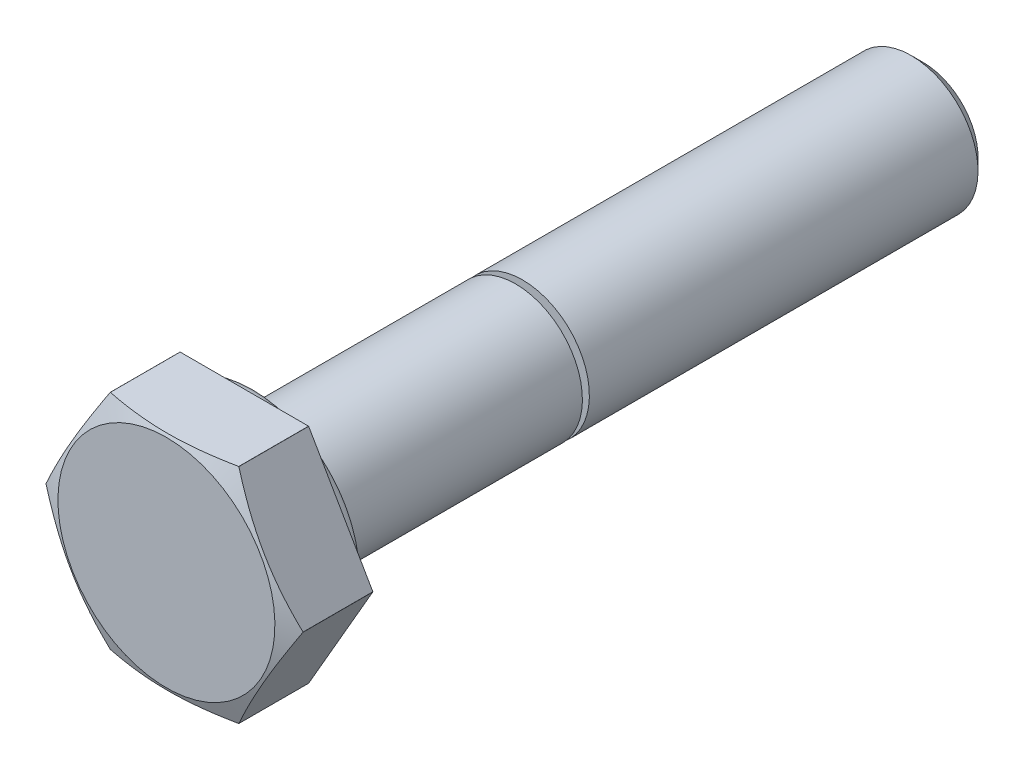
ISO-10303-21;
HEADER;
FILE_DESCRIPTION(('STEP AP214'),'2;1');
FILE_NAME('part.step','',(''),(''),'','','');
FILE_SCHEMA(('AUTOMOTIVE_DESIGN { 1 0 10303 214 1 1 1 1 }'));
ENDSEC;
DATA;
#1=APPLICATION_CONTEXT('core data for automotive mechanical design processes');
#2=APPLICATION_PROTOCOL_DEFINITION('international standard','automotive_design',2000,#1);
#3=PRODUCT_CONTEXT('',#1,'mechanical');
#4=PRODUCT('Part','Part','',(#3));
#5=PRODUCT_RELATED_PRODUCT_CATEGORY('part','',(#4));
#6=PRODUCT_DEFINITION_FORMATION('','',#4);
#7=PRODUCT_DEFINITION_CONTEXT('part definition',#1,'design');
#8=PRODUCT_DEFINITION('design','',#6,#7);
#9=PRODUCT_DEFINITION_SHAPE('','',#8);
#10=(LENGTH_UNIT() NAMED_UNIT(*) SI_UNIT(.MILLI.,.METRE.));
#11=(NAMED_UNIT(*) PLANE_ANGLE_UNIT() SI_UNIT($,.RADIAN.));
#12=(NAMED_UNIT(*) SI_UNIT($,.STERADIAN.) SOLID_ANGLE_UNIT());
#13=UNCERTAINTY_MEASURE_WITH_UNIT(LENGTH_MEASURE(1.E-05),#10,'distance_accuracy_value','');
#14=(GEOMETRIC_REPRESENTATION_CONTEXT(3) GLOBAL_UNCERTAINTY_ASSIGNED_CONTEXT((#13)) GLOBAL_UNIT_ASSIGNED_CONTEXT((#10,
#11,#12)) REPRESENTATION_CONTEXT('',''));
#15=CARTESIAN_POINT('',(0.,0.,0.));
#16=DIRECTION('',(0.,0.,1.));
#17=DIRECTION('',(1.,0.,0.));
#18=AXIS2_PLACEMENT_3D('',#15,#16,#17);
#19=CARTESIAN_POINT('',(0.,1.229375,-30.));
#20=DIRECTION('',(0.,0.,-1.));
#21=DIRECTION('',(0.,1.,0.));
#22=AXIS2_PLACEMENT_3D('',#19,#20,#21);
#23=PLANE('',#22);
#24=CARTESIAN_POINT('',(0.,0.,-30.));
#25=DIRECTION('',(0.,0.,-1.));
#26=DIRECTION('',(0.,1.,0.));
#27=AXIS2_PLACEMENT_3D('',#24,#25,#26);
#28=CIRCLE('',#27,2.45875);
#29=CARTESIAN_POINT('',(0.,2.45875,-30.));
#30=VERTEX_POINT('',#29);
#31=EDGE_CURVE('E10',#30,#30,#28,.T.);
#32=ORIENTED_EDGE('',*,*,#31,.T.);
#33=EDGE_LOOP('',(#32));
#34=FACE_BOUND('',#33,.T.);
#35=ADVANCED_FACE('F16',(#34),#23,.T.);
#36=CARTESIAN_POINT('',(0.,0.,-29.729375));
#37=DIRECTION('',(0.,0.,1.));
#38=DIRECTION('',(0.,1.,0.));
#39=AXIS2_PLACEMENT_3D('',#36,#37,#38);
#40=CONICAL_SURFACE('',#39,2.729375,0.78539816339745);
#41=CARTESIAN_POINT('',(0.,0.,-29.45875));
#42=DIRECTION('',(0.,0.,-1.));
#43=DIRECTION('',(0.,1.,0.));
#44=AXIS2_PLACEMENT_3D('',#41,#42,#43);
#45=CIRCLE('',#44,3.);
#46=CARTESIAN_POINT('',(0.,3.,-29.45875));
#47=VERTEX_POINT('',#46);
#48=EDGE_CURVE('E19',#47,#47,#45,.T.);
#49=ORIENTED_EDGE('',*,*,#48,.T.);
#50=EDGE_LOOP('',(#49));
#51=FACE_BOUND('',#50,.T.);
#52=ORIENTED_EDGE('',*,*,#31,.F.);
#53=EDGE_LOOP('',(#52));
#54=FACE_BOUND('',#53,.T.);
#55=ADVANCED_FACE('F148',(#51,#54),#40,.T.);
#56=CARTESIAN_POINT('',(0.,0.,-20.729375));
#57=DIRECTION('',(0.,0.,1.));
#58=DIRECTION('',(0.,1.,0.));
#59=AXIS2_PLACEMENT_3D('',#56,#57,#58);
#60=CYLINDRICAL_SURFACE('',#59,3.);
#61=CARTESIAN_POINT('',(0.,0.,-12.));
#62=DIRECTION('',(0.,0.,-1.));
#63=DIRECTION('',(0.,1.,0.));
#64=AXIS2_PLACEMENT_3D('',#61,#62,#63);
#65=CIRCLE('',#64,3.);
#66=CARTESIAN_POINT('',(0.,3.,-12.));
#67=VERTEX_POINT('',#66);
#68=EDGE_CURVE('E127',#67,#67,#65,.T.);
#69=ORIENTED_EDGE('',*,*,#68,.T.);
#70=EDGE_LOOP('',(#69));
#71=FACE_BOUND('',#70,.T.);
#72=ORIENTED_EDGE('',*,*,#48,.F.);
#73=EDGE_LOOP('',(#72));
#74=FACE_BOUND('',#73,.T.);
#75=ADVANCED_FACE('F134',(#71,#74),#60,.T.);
#76=CARTESIAN_POINT('',(0.,2.729375,-12.));
#77=DIRECTION('',(0.,0.,1.));
#78=DIRECTION('',(0.,-1.,0.));
#79=AXIS2_PLACEMENT_3D('',#76,#77,#78);
#80=PLANE('',#79);
#81=CARTESIAN_POINT('',(0.,0.,-12.));
#82=DIRECTION('',(0.,0.,-1.));
#83=DIRECTION('',(0.,1.,0.));
#84=AXIS2_PLACEMENT_3D('',#81,#82,#83);
#85=CIRCLE('',#84,2.45875);
#86=CARTESIAN_POINT('',(0.,2.45875,-12.));
#87=VERTEX_POINT('',#86);
#88=EDGE_CURVE('E124',#87,#87,#85,.T.);
#89=ORIENTED_EDGE('',*,*,#88,.T.);
#90=EDGE_LOOP('',(#89));
#91=FACE_BOUND('',#90,.T.);
#92=ORIENTED_EDGE('',*,*,#68,.F.);
#93=EDGE_LOOP('',(#92));
#94=FACE_BOUND('',#93,.T.);
#95=ADVANCED_FACE('F137',(#91,#94),#80,.T.);
#96=CARTESIAN_POINT('',(0.,0.,-11.8437545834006));
#97=DIRECTION('',(0.,0.,1.));
#98=DIRECTION('',(0.,1.,0.));
#99=AXIS2_PLACEMENT_3D('',#96,#97,#98);
#100=CONICAL_SURFACE('',#99,2.729375,1.0471975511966);
#101=CARTESIAN_POINT('',(0.,0.,-11.6875091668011));
#102=DIRECTION('',(0.,0.,-1.));
#103=DIRECTION('',(0.,1.,0.));
#104=AXIS2_PLACEMENT_3D('',#101,#102,#103);
#105=CIRCLE('',#104,3.);
#106=CARTESIAN_POINT('',(0.,3.,-11.6875091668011));
#107=VERTEX_POINT('',#106);
#108=EDGE_CURVE('E120',#107,#107,#105,.T.);
#109=ORIENTED_EDGE('',*,*,#108,.T.);
#110=EDGE_LOOP('',(#109));
#111=FACE_BOUND('',#110,.T.);
#112=ORIENTED_EDGE('',*,*,#88,.F.);
#113=EDGE_LOOP('',(#112));
#114=FACE_BOUND('',#113,.T.);
#115=ADVANCED_FACE('F121',(#111,#114),#100,.T.);
#116=CARTESIAN_POINT('',(0.,0.,-5.99375458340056));
#117=DIRECTION('',(0.,0.,1.));
#118=DIRECTION('',(0.,1.,0.));
#119=AXIS2_PLACEMENT_3D('',#116,#117,#118);
#120=CYLINDRICAL_SURFACE('',#119,3.);
#121=CARTESIAN_POINT('',(0.,0.,-0.3));
#122=DIRECTION('',(0.,0.,-1.));
#123=DIRECTION('',(0.,1.,0.));
#124=AXIS2_PLACEMENT_3D('',#121,#122,#123);
#125=CIRCLE('',#124,3.);
#126=CARTESIAN_POINT('',(0.,3.,-0.3));
#127=VERTEX_POINT('',#126);
#128=EDGE_CURVE('E125',#127,#127,#125,.T.);
#129=ORIENTED_EDGE('',*,*,#128,.T.);
#130=EDGE_LOOP('',(#129));
#131=FACE_BOUND('',#130,.T.);
#132=ORIENTED_EDGE('',*,*,#108,.F.);
#133=EDGE_LOOP('',(#132));
#134=FACE_BOUND('',#133,.T.);
#135=ADVANCED_FACE('F146',(#131,#134),#120,.T.);
#136=CARTESIAN_POINT('',(0.,0.,-0.3));
#137=DIRECTION('',(0.,0.,-1.));
#138=DIRECTION('',(-1.,0.,0.));
#139=AXIS2_PLACEMENT_3D('',#136,#137,#138);
#140=TOROIDAL_SURFACE('',#139,3.3,0.3);
#141=CARTESIAN_POINT('',(0.,0.,0.));
#142=DIRECTION('',(0.,0.,-1.));
#143=DIRECTION('',(0.,1.,0.));
#144=AXIS2_PLACEMENT_3D('',#141,#142,#143);
#145=CIRCLE('',#144,3.3);
#146=CARTESIAN_POINT('',(0.,3.3,0.));
#147=VERTEX_POINT('',#146);
#148=EDGE_CURVE('E129',#147,#147,#145,.T.);
#149=ORIENTED_EDGE('',*,*,#148,.T.);
#150=EDGE_LOOP('',(#149));
#151=FACE_BOUND('',#150,.T.);
#152=ORIENTED_EDGE('',*,*,#128,.F.);
#153=EDGE_LOOP('',(#152));
#154=FACE_BOUND('',#153,.T.);
#155=ADVANCED_FACE('F191',(#151,#154),#140,.F.);
#156=CARTESIAN_POINT('',(0.,3.875,0.));
#157=DIRECTION('',(0.,0.,-1.));
#158=DIRECTION('',(0.,1.,0.));
#159=AXIS2_PLACEMENT_3D('',#156,#157,#158);
#160=PLANE('',#159);
#161=CARTESIAN_POINT('',(0.,0.,0.));
#162=DIRECTION('',(0.,0.,-1.));
#163=DIRECTION('',(0.,1.,0.));
#164=AXIS2_PLACEMENT_3D('',#161,#162,#163);
#165=CIRCLE('',#164,4.45);
#166=CARTESIAN_POINT('',(0.,4.45,0.));
#167=VERTEX_POINT('',#166);
#168=EDGE_CURVE('E422',#167,#167,#165,.T.);
#169=ORIENTED_EDGE('',*,*,#168,.T.);
#170=EDGE_LOOP('',(#169));
#171=FACE_BOUND('',#170,.T.);
#172=ORIENTED_EDGE('',*,*,#148,.F.);
#173=EDGE_LOOP('',(#172));
#174=FACE_BOUND('',#173,.T.);
#175=ADVANCED_FACE('F200',(#171,#174),#160,.T.);
#176=CARTESIAN_POINT('',(0.,0.,0.5));
#177=DIRECTION('',(0.,0.,-1.));
#178=DIRECTION('',(-1.,0.,0.));
#179=AXIS2_PLACEMENT_3D('',#176,#177,#178);
#180=TOROIDAL_SURFACE('',#179,4.45,0.5);
#181=CARTESIAN_POINT('',(0.,0.,0.5));
#182=DIRECTION('',(0.,0.,-1.));
#183=DIRECTION('',(0.,1.,0.));
#184=AXIS2_PLACEMENT_3D('',#181,#182,#183);
#185=CIRCLE('',#184,4.95);
#186=CARTESIAN_POINT('',(0.,4.95,0.5));
#187=VERTEX_POINT('',#186);
#188=EDGE_CURVE('E424',#187,#187,#185,.T.);
#189=ORIENTED_EDGE('',*,*,#188,.T.);
#190=EDGE_LOOP('',(#189));
#191=FACE_BOUND('',#190,.T.);
#192=ORIENTED_EDGE('',*,*,#168,.F.);
#193=EDGE_LOOP('',(#192));
#194=FACE_BOUND('',#193,.T.);
#195=ADVANCED_FACE('F210',(#191,#194),#180,.T.);
#196=CARTESIAN_POINT('',(0.,5.36175,0.5));
#197=DIRECTION('',(0.,0.,-1.));
#198=DIRECTION('',(0.,1.,0.));
#199=AXIS2_PLACEMENT_3D('',#196,#197,#198);
#200=PLANE('',#199);
#201=ORIENTED_EDGE('',*,*,#188,.F.);
#202=EDGE_LOOP('',(#201));
#203=FACE_BOUND('',#202,.T.);
#204=DIRECTION('',(0.5,-0.866025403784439,0.));
#205=VECTOR('',#204,1.);
#206=CARTESIAN_POINT('',(-5.4921029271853,-0.489992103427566,0.5));
#207=LINE('',#206,#205);
#208=CARTESIAN_POINT('',(-5.77349941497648,-0.00259908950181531,0.5));
#209=VERTEX_POINT('',#208);
#210=CARTESIAN_POINT('',(-2.88900058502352,-4.99869761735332,0.5));
#211=VERTEX_POINT('',#210);
#212=EDGE_CURVE('E390',#209,#211,#207,.T.);
#213=ORIENTED_EDGE('',*,*,#212,.F.);
#214=CARTESIAN_POINT('',(0.,0.,0.5));
#215=DIRECTION('',(0.,0.,-1.));
#216=DIRECTION('',(0.,1.,0.));
#217=AXIS2_PLACEMENT_3D('',#214,#215,#216);
#218=CIRCLE('',#217,5.7735);
#219=CARTESIAN_POINT('',(-5.77349941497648,0.00259908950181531,0.5));
#220=VERTEX_POINT('',#219);
#221=EDGE_CURVE('E511',#209,#220,#218,.T.);
#222=ORIENTED_EDGE('',*,*,#221,.T.);
#223=DIRECTION('',(-0.5,-0.866025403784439,0.));
#224=VECTOR('',#223,1.);
#225=CARTESIAN_POINT('',(-3.1703970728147,4.51130460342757,0.5));
#226=LINE('',#225,#224);
#227=CARTESIAN_POINT('',(-2.88900058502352,4.99869761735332,0.5));
#228=VERTEX_POINT('',#227);
#229=EDGE_CURVE('E481',#228,#220,#226,.T.);
#230=ORIENTED_EDGE('',*,*,#229,.F.);
#231=CARTESIAN_POINT('',(0.,0.,0.5));
#232=DIRECTION('',(0.,0.,-1.));
#233=DIRECTION('',(0.,1.,0.));
#234=AXIS2_PLACEMENT_3D('',#231,#232,#233);
#235=CIRCLE('',#234,5.7735);
#236=CARTESIAN_POINT('',(-2.88449882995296,5.00129670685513,0.5));
#237=VERTEX_POINT('',#236);
#238=EDGE_CURVE('E500',#228,#237,#235,.T.);
#239=ORIENTED_EDGE('',*,*,#238,.T.);
#240=DIRECTION('',(-1.,0.,0.));
#241=VECTOR('',#240,1.);
#242=CARTESIAN_POINT('',(0.,5.00129670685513,0.5));
#243=LINE('',#242,#241);
#244=CARTESIAN_POINT('',(2.88449882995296,5.00129670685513,0.5));
#245=VERTEX_POINT('',#244);
#246=EDGE_CURVE('E464',#245,#237,#243,.T.);
#247=ORIENTED_EDGE('',*,*,#246,.F.);
#248=CARTESIAN_POINT('',(0.,0.,0.5));
#249=DIRECTION('',(0.,0.,-1.));
#250=DIRECTION('',(0.,1.,0.));
#251=AXIS2_PLACEMENT_3D('',#248,#249,#250);
#252=CIRCLE('',#251,5.7735);
#253=CARTESIAN_POINT('',(2.88900058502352,4.99869761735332,0.5));
#254=VERTEX_POINT('',#253);
#255=EDGE_CURVE('E491',#245,#254,#252,.T.);
#256=ORIENTED_EDGE('',*,*,#255,.T.);
#257=DIRECTION('',(-0.5,0.866025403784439,0.));
#258=VECTOR('',#257,1.);
#259=CARTESIAN_POINT('',(3.1703970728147,4.51130460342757,0.5));
#260=LINE('',#259,#258);
#261=CARTESIAN_POINT('',(5.77349941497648,0.00259908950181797,0.5));
#262=VERTEX_POINT('',#261);
#263=EDGE_CURVE('E395',#262,#254,#260,.T.);
#264=ORIENTED_EDGE('',*,*,#263,.F.);
#265=CARTESIAN_POINT('',(0.,0.,0.5));
#266=DIRECTION('',(0.,0.,-1.));
#267=DIRECTION('',(0.,1.,0.));
#268=AXIS2_PLACEMENT_3D('',#265,#266,#267);
#269=CIRCLE('',#268,5.7735);
#270=CARTESIAN_POINT('',(5.77349941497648,-0.00259908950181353,0.5));
#271=VERTEX_POINT('',#270);
#272=EDGE_CURVE('E487',#262,#271,#269,.T.);
#273=ORIENTED_EDGE('',*,*,#272,.T.);
#274=DIRECTION('',(0.5,0.866025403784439,0.));
#275=VECTOR('',#274,1.);
#276=CARTESIAN_POINT('',(5.49210292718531,-0.489992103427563,0.5));
#277=LINE('',#276,#275);
#278=CARTESIAN_POINT('',(2.88900058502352,-4.99869761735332,0.5));
#279=VERTEX_POINT('',#278);
#280=EDGE_CURVE('E403',#279,#271,#277,.T.);
#281=ORIENTED_EDGE('',*,*,#280,.F.);
#282=CARTESIAN_POINT('',(0.,0.,0.5));
#283=DIRECTION('',(0.,0.,-1.));
#284=DIRECTION('',(0.,1.,0.));
#285=AXIS2_PLACEMENT_3D('',#282,#283,#284);
#286=CIRCLE('',#285,5.7735);
#287=CARTESIAN_POINT('',(2.88449882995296,-5.00129670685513,0.5));
#288=VERTEX_POINT('',#287);
#289=EDGE_CURVE('E496',#279,#288,#286,.T.);
#290=ORIENTED_EDGE('',*,*,#289,.T.);
#291=DIRECTION('',(1.,0.,0.));
#292=VECTOR('',#291,1.);
#293=CARTESIAN_POINT('',(0.,-5.00129670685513,0.5));
#294=LINE('',#293,#292);
#295=CARTESIAN_POINT('',(-2.88449882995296,-5.00129670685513,0.5));
#296=VERTEX_POINT('',#295);
#297=EDGE_CURVE('E421',#296,#288,#294,.T.);
#298=ORIENTED_EDGE('',*,*,#297,.F.);
#299=CARTESIAN_POINT('',(0.,0.,0.5));
#300=DIRECTION('',(0.,0.,-1.));
#301=DIRECTION('',(0.,1.,0.));
#302=AXIS2_PLACEMENT_3D('',#299,#300,#301);
#303=CIRCLE('',#302,5.7735);
#304=EDGE_CURVE('E504',#296,#211,#303,.T.);
#305=ORIENTED_EDGE('',*,*,#304,.T.);
#306=EDGE_LOOP('',(#213,#222,#230,#239,#247,#256,#264,#273,#281,#290,#298,#305));
#307=FACE_BOUND('',#306,.T.);
#308=ADVANCED_FACE('F220',(#203,#307),#200,.T.);
#309=CARTESIAN_POINT('',(0.,2.43673420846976,4.));
#310=DIRECTION('',(0.,0.,1.));
#311=DIRECTION('',(0.,-1.,0.));
#312=AXIS2_PLACEMENT_3D('',#309,#310,#311);
#313=PLANE('',#312);
#314=CARTESIAN_POINT('',(0.,0.,4.));
#315=DIRECTION('',(0.,0.,-1.));
#316=DIRECTION('',(0.,1.,0.));
#317=AXIS2_PLACEMENT_3D('',#314,#315,#316);
#318=CIRCLE('',#317,4.87346841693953);
#319=CARTESIAN_POINT('',(0.,4.87346841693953,4.));
#320=VERTEX_POINT('',#319);
#321=EDGE_CURVE('E513',#320,#320,#318,.T.);
#322=ORIENTED_EDGE('',*,*,#321,.F.);
#323=EDGE_LOOP('',(#322));
#324=FACE_BOUND('',#323,.T.);
#325=ADVANCED_FACE('F230',(#324),#313,.T.);
#326=CARTESIAN_POINT('',(0.,0.,3.81818181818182));
#327=DIRECTION('',(0.,0.,-1.));
#328=DIRECTION('',(0.,1.,0.));
#329=AXIS2_PLACEMENT_3D('',#326,#327,#328);
#330=CONICAL_SURFACE('',#329,5.32348420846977,1.18682389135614);
#331=CARTESIAN_POINT('',(-2.88900058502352,-4.99869761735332,3.63636363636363));
#332=CARTESIAN_POINT('',(-4.33125000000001,-2.50064835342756,4.21861581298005));
#333=CARTESIAN_POINT('',(-5.77349941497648,-0.00259908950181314,3.63636363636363));
#334=(BOUNDED_CURVE() B_SPLINE_CURVE(2,(#331,#332,#333),.UNSPECIFIED.,.F.,
.F.) B_SPLINE_CURVE_WITH_KNOTS((3,3),(0.,5.80264474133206),
.UNSPECIFIED.) CURVE() GEOMETRIC_REPRESENTATION_ITEM() RATIONAL_B_SPLINE_CURVE((1.,
1.15440061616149,1.)) REPRESENTATION_ITEM(''));
#335=CARTESIAN_POINT('',(-2.88900058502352,-4.99869761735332,3.63636363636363));
#336=VERTEX_POINT('',#335);
#337=CARTESIAN_POINT('',(-5.77349941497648,-0.00259908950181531,3.63636363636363));
#338=VERTEX_POINT('',#337);
#339=EDGE_CURVE('E380',#336,#338,#334,.T.);
#340=ORIENTED_EDGE('',*,*,#339,.F.);
#341=CARTESIAN_POINT('',(0.,0.,3.63636363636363));
#342=DIRECTION('',(0.,0.,-1.));
#343=DIRECTION('',(0.,1.,0.));
#344=AXIS2_PLACEMENT_3D('',#341,#342,#343);
#345=CIRCLE('',#344,5.7735);
#346=CARTESIAN_POINT('',(-2.88449882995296,-5.00129670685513,3.63636363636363));
#347=VERTEX_POINT('',#346);
#348=EDGE_CURVE('E506',#347,#336,#345,.T.);
#349=ORIENTED_EDGE('',*,*,#348,.F.);
#350=CARTESIAN_POINT('',(2.88449882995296,-5.00129670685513,3.63636363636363));
#351=CARTESIAN_POINT('',(0.,-5.00129670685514,4.21861581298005));
#352=CARTESIAN_POINT('',(-2.88449882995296,-5.00129670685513,3.63636363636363));
#353=(BOUNDED_CURVE() B_SPLINE_CURVE(2,(#350,#351,#352),.UNSPECIFIED.,.F.,
.F.) B_SPLINE_CURVE_WITH_KNOTS((3,3),(0.,5.80264474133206),
.UNSPECIFIED.) CURVE() GEOMETRIC_REPRESENTATION_ITEM() RATIONAL_B_SPLINE_CURVE((1.,
1.15440061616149,1.)) REPRESENTATION_ITEM(''));
#354=CARTESIAN_POINT('',(2.88449882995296,-5.00129670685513,3.63636363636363));
#355=VERTEX_POINT('',#354);
#356=EDGE_CURVE('E409',#355,#347,#353,.T.);
#357=ORIENTED_EDGE('',*,*,#356,.F.);
#358=CARTESIAN_POINT('',(0.,0.,3.63636363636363));
#359=DIRECTION('',(0.,0.,-1.));
#360=DIRECTION('',(0.,1.,0.));
#361=AXIS2_PLACEMENT_3D('',#358,#359,#360);
#362=CIRCLE('',#361,5.7735);
#363=CARTESIAN_POINT('',(2.88900058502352,-4.99869761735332,3.63636363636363));
#364=VERTEX_POINT('',#363);
#365=EDGE_CURVE('E498',#364,#355,#362,.T.);
#366=ORIENTED_EDGE('',*,*,#365,.F.);
#367=CARTESIAN_POINT('',(5.77349941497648,-0.00259908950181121,3.63636363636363));
#368=CARTESIAN_POINT('',(4.33125,-2.50064835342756,4.21861581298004));
#369=CARTESIAN_POINT('',(2.88900058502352,-4.99869761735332,3.63636363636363));
#370=(BOUNDED_CURVE() B_SPLINE_CURVE(2,(#367,#368,#369),.UNSPECIFIED.,.F.,
.F.) B_SPLINE_CURVE_WITH_KNOTS((3,3),(0.,5.80264474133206),
.UNSPECIFIED.) CURVE() GEOMETRIC_REPRESENTATION_ITEM() RATIONAL_B_SPLINE_CURVE((1.,
1.15440061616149,1.)) REPRESENTATION_ITEM(''));
#371=CARTESIAN_POINT('',(5.77349941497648,-0.00259908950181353,3.63636363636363));
#372=VERTEX_POINT('',#371);
#373=EDGE_CURVE('E404',#372,#364,#370,.T.);
#374=ORIENTED_EDGE('',*,*,#373,.F.);
#375=CARTESIAN_POINT('',(0.,0.,3.63636363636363));
#376=DIRECTION('',(0.,0.,-1.));
#377=DIRECTION('',(0.,1.,0.));
#378=AXIS2_PLACEMENT_3D('',#375,#376,#377);
#379=CIRCLE('',#378,5.7735);
#380=CARTESIAN_POINT('',(5.77349941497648,0.00259908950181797,3.63636363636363));
#381=VERTEX_POINT('',#380);
#382=EDGE_CURVE('E489',#381,#372,#379,.T.);
#383=ORIENTED_EDGE('',*,*,#382,.F.);
#384=CARTESIAN_POINT('',(2.88900058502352,4.99869761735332,3.63636363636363));
#385=CARTESIAN_POINT('',(4.33125000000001,2.50064835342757,4.21861581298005));
#386=CARTESIAN_POINT('',(5.77349941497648,0.00259908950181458,3.63636363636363));
#387=(BOUNDED_CURVE() B_SPLINE_CURVE(2,(#384,#385,#386),.UNSPECIFIED.,.F.,
.F.) B_SPLINE_CURVE_WITH_KNOTS((3,3),(0.,5.80264474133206),
.UNSPECIFIED.) CURVE() GEOMETRIC_REPRESENTATION_ITEM() RATIONAL_B_SPLINE_CURVE((1.,
1.15440061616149,1.)) REPRESENTATION_ITEM(''));
#388=CARTESIAN_POINT('',(2.88900058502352,4.99869761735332,3.63636363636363));
#389=VERTEX_POINT('',#388);
#390=EDGE_CURVE('E443',#389,#381,#387,.T.);
#391=ORIENTED_EDGE('',*,*,#390,.F.);
#392=CARTESIAN_POINT('',(0.,0.,3.63636363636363));
#393=DIRECTION('',(0.,0.,-1.));
#394=DIRECTION('',(0.,1.,0.));
#395=AXIS2_PLACEMENT_3D('',#392,#393,#394);
#396=CIRCLE('',#395,5.7735);
#397=CARTESIAN_POINT('',(2.88449882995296,5.00129670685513,3.63636363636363));
#398=VERTEX_POINT('',#397);
#399=EDGE_CURVE('E493',#398,#389,#396,.T.);
#400=ORIENTED_EDGE('',*,*,#399,.F.);
#401=CARTESIAN_POINT('',(-2.88449882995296,5.00129670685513,3.63636363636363));
#402=CARTESIAN_POINT('',(0.,5.00129670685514,4.21861581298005));
#403=CARTESIAN_POINT('',(2.88449882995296,5.00129670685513,3.63636363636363));
#404=(BOUNDED_CURVE() B_SPLINE_CURVE(2,(#401,#402,#403),.UNSPECIFIED.,.F.,
.F.) B_SPLINE_CURVE_WITH_KNOTS((3,3),(0.,5.80264474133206),
.UNSPECIFIED.) CURVE() GEOMETRIC_REPRESENTATION_ITEM() RATIONAL_B_SPLINE_CURVE((1.,
1.15440061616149,1.)) REPRESENTATION_ITEM(''));
#405=CARTESIAN_POINT('',(-2.88449882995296,5.00129670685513,3.63636363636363));
#406=VERTEX_POINT('',#405);
#407=EDGE_CURVE('E433',#406,#398,#404,.T.);
#408=ORIENTED_EDGE('',*,*,#407,.F.);
#409=CARTESIAN_POINT('',(0.,0.,3.63636363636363));
#410=DIRECTION('',(0.,0.,-1.));
#411=DIRECTION('',(0.,1.,0.));
#412=AXIS2_PLACEMENT_3D('',#409,#410,#411);
#413=CIRCLE('',#412,5.7735);
#414=CARTESIAN_POINT('',(-2.88900058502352,4.99869761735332,3.63636363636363));
#415=VERTEX_POINT('',#414);
#416=EDGE_CURVE('E502',#415,#406,#413,.T.);
#417=ORIENTED_EDGE('',*,*,#416,.F.);
#418=CARTESIAN_POINT('',(-5.77349941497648,0.00259908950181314,3.63636363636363));
#419=CARTESIAN_POINT('',(-4.33125000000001,2.50064835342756,4.21861581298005));
#420=CARTESIAN_POINT('',(-2.88900058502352,4.99869761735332,3.63636363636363));
#421=(BOUNDED_CURVE() B_SPLINE_CURVE(2,(#418,#419,#420),.UNSPECIFIED.,.F.,
.F.) B_SPLINE_CURVE_WITH_KNOTS((3,3),(0.,5.80264474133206),
.UNSPECIFIED.) CURVE() GEOMETRIC_REPRESENTATION_ITEM() RATIONAL_B_SPLINE_CURVE((1.,
1.15440061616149,1.)) REPRESENTATION_ITEM(''));
#422=CARTESIAN_POINT('',(-5.77349941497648,0.00259908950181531,3.63636363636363));
#423=VERTEX_POINT('',#422);
#424=EDGE_CURVE('E470',#423,#415,#421,.T.);
#425=ORIENTED_EDGE('',*,*,#424,.F.);
#426=CARTESIAN_POINT('',(0.,0.,3.63636363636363));
#427=DIRECTION('',(0.,0.,-1.));
#428=DIRECTION('',(0.,1.,0.));
#429=AXIS2_PLACEMENT_3D('',#426,#427,#428);
#430=CIRCLE('',#429,5.7735);
#431=EDGE_CURVE('E509',#338,#423,#430,.T.);
#432=ORIENTED_EDGE('',*,*,#431,.F.);
#433=EDGE_LOOP('',(#340,#349,#357,#366,#374,#383,#391,#400,#408,#417,#425,#432));
#434=FACE_BOUND('',#433,.T.);
#435=ORIENTED_EDGE('',*,*,#321,.T.);
#436=EDGE_LOOP('',(#435));
#437=FACE_BOUND('',#436,.T.);
#438=ADVANCED_FACE('F240',(#434,#437),#330,.T.);
#439=CARTESIAN_POINT('',(0.,0.,2.06818181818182));
#440=DIRECTION('',(0.,0.,1.));
#441=DIRECTION('',(0.,1.,0.));
#442=AXIS2_PLACEMENT_3D('',#439,#440,#441);
#443=CYLINDRICAL_SURFACE('',#442,5.7735);
#444=DIRECTION('',(0.,0.,-1.));
#445=VECTOR('',#444,1.);
#446=CARTESIAN_POINT('',(-5.77349941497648,-0.00259908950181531,2.06818181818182));
#447=LINE('',#446,#445);
#448=EDGE_CURVE('E383',#338,#209,#447,.T.);
#449=ORIENTED_EDGE('',*,*,#448,.F.);
#450=ORIENTED_EDGE('',*,*,#431,.T.);
#451=DIRECTION('',(0.,0.,1.));
#452=VECTOR('',#451,1.);
#453=CARTESIAN_POINT('',(-5.77349941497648,0.00259908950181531,2.06818181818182));
#454=LINE('',#453,#452);
#455=EDGE_CURVE('E484',#220,#423,#454,.T.);
#456=ORIENTED_EDGE('',*,*,#455,.F.);
#457=ORIENTED_EDGE('',*,*,#221,.F.);
#458=EDGE_LOOP('',(#449,#450,#456,#457));
#459=FACE_BOUND('',#458,.T.);
#460=ADVANCED_FACE('F250',(#459),#443,.T.);
#461=CARTESIAN_POINT('',(0.,0.,2.06818181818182));
#462=DIRECTION('',(0.,0.,1.));
#463=DIRECTION('',(0.,1.,0.));
#464=AXIS2_PLACEMENT_3D('',#461,#462,#463);
#465=CYLINDRICAL_SURFACE('',#464,5.7735);
#466=DIRECTION('',(0.,0.,1.));
#467=VECTOR('',#466,1.);
#468=CARTESIAN_POINT('',(-2.88900058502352,-4.99869761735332,2.06818181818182));
#469=LINE('',#468,#467);
#470=EDGE_CURVE('E386',#211,#336,#469,.T.);
#471=ORIENTED_EDGE('',*,*,#470,.F.);
#472=ORIENTED_EDGE('',*,*,#304,.F.);
#473=DIRECTION('',(0.,0.,-1.));
#474=VECTOR('',#473,1.);
#475=CARTESIAN_POINT('',(-2.88449882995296,-5.00129670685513,2.06818181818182));
#476=LINE('',#475,#474);
#477=EDGE_CURVE('E415',#347,#296,#476,.T.);
#478=ORIENTED_EDGE('',*,*,#477,.F.);
#479=ORIENTED_EDGE('',*,*,#348,.T.);
#480=EDGE_LOOP('',(#471,#472,#478,#479));
#481=FACE_BOUND('',#480,.T.);
#482=ADVANCED_FACE('F260',(#481),#465,.T.);
#483=CARTESIAN_POINT('',(0.,0.,2.06818181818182));
#484=DIRECTION('',(0.,0.,1.));
#485=DIRECTION('',(0.,1.,0.));
#486=AXIS2_PLACEMENT_3D('',#483,#484,#485);
#487=CYLINDRICAL_SURFACE('',#486,5.7735);
#488=DIRECTION('',(0.,0.,1.));
#489=VECTOR('',#488,1.);
#490=CARTESIAN_POINT('',(-2.88449882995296,5.00129670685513,2.06818181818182));
#491=LINE('',#490,#489);
#492=EDGE_CURVE('E467',#237,#406,#491,.T.);
#493=ORIENTED_EDGE('',*,*,#492,.F.);
#494=ORIENTED_EDGE('',*,*,#238,.F.);
#495=DIRECTION('',(0.,0.,-1.));
#496=VECTOR('',#495,1.);
#497=CARTESIAN_POINT('',(-2.88900058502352,4.99869761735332,2.06818181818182));
#498=LINE('',#497,#496);
#499=EDGE_CURVE('E475',#415,#228,#498,.T.);
#500=ORIENTED_EDGE('',*,*,#499,.F.);
#501=ORIENTED_EDGE('',*,*,#416,.T.);
#502=EDGE_LOOP('',(#493,#494,#500,#501));
#503=FACE_BOUND('',#502,.T.);
#504=ADVANCED_FACE('F270',(#503),#487,.T.);
#505=CARTESIAN_POINT('',(0.,0.,2.06818181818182));
#506=DIRECTION('',(0.,0.,1.));
#507=DIRECTION('',(0.,1.,0.));
#508=AXIS2_PLACEMENT_3D('',#505,#506,#507);
#509=CYLINDRICAL_SURFACE('',#508,5.7735);
#510=DIRECTION('',(0.,0.,1.));
#511=VECTOR('',#510,1.);
#512=CARTESIAN_POINT('',(2.88449882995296,-5.00129670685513,2.06818181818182));
#513=LINE('',#512,#511);
#514=EDGE_CURVE('E427',#288,#355,#513,.T.);
#515=ORIENTED_EDGE('',*,*,#514,.F.);
#516=ORIENTED_EDGE('',*,*,#289,.F.);
#517=DIRECTION('',(0.,0.,-1.));
#518=VECTOR('',#517,1.);
#519=CARTESIAN_POINT('',(2.88900058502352,-4.99869761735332,2.06818181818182));
#520=LINE('',#519,#518);
#521=EDGE_CURVE('E400',#364,#279,#520,.T.);
#522=ORIENTED_EDGE('',*,*,#521,.F.);
#523=ORIENTED_EDGE('',*,*,#365,.T.);
#524=EDGE_LOOP('',(#515,#516,#522,#523));
#525=FACE_BOUND('',#524,.T.);
#526=ADVANCED_FACE('F280',(#525),#509,.T.);
#527=CARTESIAN_POINT('',(0.,0.,2.06818181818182));
#528=DIRECTION('',(0.,0.,1.));
#529=DIRECTION('',(0.,1.,0.));
#530=AXIS2_PLACEMENT_3D('',#527,#528,#529);
#531=CYLINDRICAL_SURFACE('',#530,5.7735);
#532=DIRECTION('',(0.,0.,1.));
#533=VECTOR('',#532,1.);
#534=CARTESIAN_POINT('',(2.88900058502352,4.99869761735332,2.06818181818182));
#535=LINE('',#534,#533);
#536=EDGE_CURVE('E430',#254,#389,#535,.T.);
#537=ORIENTED_EDGE('',*,*,#536,.F.);
#538=ORIENTED_EDGE('',*,*,#255,.F.);
#539=DIRECTION('',(0.,0.,-1.));
#540=VECTOR('',#539,1.);
#541=CARTESIAN_POINT('',(2.88449882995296,5.00129670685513,2.06818181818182));
#542=LINE('',#541,#540);
#543=EDGE_CURVE('E458',#398,#245,#542,.T.);
#544=ORIENTED_EDGE('',*,*,#543,.F.);
#545=ORIENTED_EDGE('',*,*,#399,.T.);
#546=EDGE_LOOP('',(#537,#538,#544,#545));
#547=FACE_BOUND('',#546,.T.);
#548=ADVANCED_FACE('F290',(#547),#531,.T.);
#549=CARTESIAN_POINT('',(0.,0.,2.06818181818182));
#550=DIRECTION('',(0.,0.,1.));
#551=DIRECTION('',(0.,1.,0.));
#552=AXIS2_PLACEMENT_3D('',#549,#550,#551);
#553=CYLINDRICAL_SURFACE('',#552,5.7735);
#554=DIRECTION('',(0.,0.,1.));
#555=VECTOR('',#554,1.);
#556=CARTESIAN_POINT('',(5.77349941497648,-0.00259908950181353,2.06818181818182));
#557=LINE('',#556,#555);
#558=EDGE_CURVE('E408',#271,#372,#557,.T.);
#559=ORIENTED_EDGE('',*,*,#558,.F.);
#560=ORIENTED_EDGE('',*,*,#272,.F.);
#561=DIRECTION('',(0.,0.,-1.));
#562=VECTOR('',#561,1.);
#563=CARTESIAN_POINT('',(5.77349941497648,0.00259908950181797,2.06818181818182));
#564=LINE('',#563,#562);
#565=EDGE_CURVE('E448',#381,#262,#564,.T.);
#566=ORIENTED_EDGE('',*,*,#565,.F.);
#567=ORIENTED_EDGE('',*,*,#382,.T.);
#568=EDGE_LOOP('',(#559,#560,#566,#567));
#569=FACE_BOUND('',#568,.T.);
#570=ADVANCED_FACE('F300',(#569),#553,.T.);
#571=CARTESIAN_POINT('',(-4.33125,2.50064835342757,4.));
#572=DIRECTION('',(-0.866025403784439,0.5,0.));
#573=DIRECTION('',(0.5,0.866025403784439,0.));
#574=AXIS2_PLACEMENT_3D('',#571,#572,#573);
#575=PLANE('',#574);
#576=ORIENTED_EDGE('',*,*,#424,.T.);
#577=ORIENTED_EDGE('',*,*,#499,.T.);
#578=ORIENTED_EDGE('',*,*,#229,.T.);
#579=ORIENTED_EDGE('',*,*,#455,.T.);
#580=EDGE_LOOP('',(#576,#577,#578,#579));
#581=FACE_BOUND('',#580,.T.);
#582=ADVANCED_FACE('F310',(#581),#575,.T.);
#583=CARTESIAN_POINT('',(0.,5.00129670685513,4.));
#584=DIRECTION('',(0.,1.,0.));
#585=DIRECTION('',(1.,0.,0.));
#586=AXIS2_PLACEMENT_3D('',#583,#584,#585);
#587=PLANE('',#586);
#588=ORIENTED_EDGE('',*,*,#407,.T.);
#589=ORIENTED_EDGE('',*,*,#543,.T.);
#590=ORIENTED_EDGE('',*,*,#246,.T.);
#591=ORIENTED_EDGE('',*,*,#492,.T.);
#592=EDGE_LOOP('',(#588,#589,#590,#591));
#593=FACE_BOUND('',#592,.T.);
#594=ADVANCED_FACE('F320',(#593),#587,.T.);
#595=CARTESIAN_POINT('',(4.33125,2.50064835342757,4.));
#596=DIRECTION('',(0.866025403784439,0.5,0.));
#597=DIRECTION('',(0.5,-0.866025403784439,0.));
#598=AXIS2_PLACEMENT_3D('',#595,#596,#597);
#599=PLANE('',#598);
#600=ORIENTED_EDGE('',*,*,#390,.T.);
#601=ORIENTED_EDGE('',*,*,#565,.T.);
#602=ORIENTED_EDGE('',*,*,#263,.T.);
#603=ORIENTED_EDGE('',*,*,#536,.T.);
#604=EDGE_LOOP('',(#600,#601,#602,#603));
#605=FACE_BOUND('',#604,.T.);
#606=ADVANCED_FACE('F330',(#605),#599,.T.);
#607=CARTESIAN_POINT('',(4.33125,-2.50064835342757,4.));
#608=DIRECTION('',(0.866025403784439,-0.5,0.));
#609=DIRECTION('',(-0.5,-0.866025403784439,0.));
#610=AXIS2_PLACEMENT_3D('',#607,#608,#609);
#611=PLANE('',#610);
#612=ORIENTED_EDGE('',*,*,#373,.T.);
#613=ORIENTED_EDGE('',*,*,#521,.T.);
#614=ORIENTED_EDGE('',*,*,#280,.T.);
#615=ORIENTED_EDGE('',*,*,#558,.T.);
#616=EDGE_LOOP('',(#612,#613,#614,#615));
#617=FACE_BOUND('',#616,.T.);
#618=ADVANCED_FACE('F340',(#617),#611,.T.);
#619=CARTESIAN_POINT('',(0.,-5.00129670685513,4.));
#620=DIRECTION('',(0.,-1.,0.));
#621=DIRECTION('',(-1.,0.,0.));
#622=AXIS2_PLACEMENT_3D('',#619,#620,#621);
#623=PLANE('',#622);
#624=ORIENTED_EDGE('',*,*,#356,.T.);
#625=ORIENTED_EDGE('',*,*,#477,.T.);
#626=ORIENTED_EDGE('',*,*,#297,.T.);
#627=ORIENTED_EDGE('',*,*,#514,.T.);
#628=EDGE_LOOP('',(#624,#625,#626,#627));
#629=FACE_BOUND('',#628,.T.);
#630=ADVANCED_FACE('F350',(#629),#623,.T.);
#631=CARTESIAN_POINT('',(-4.33125,-2.50064835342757,4.));
#632=DIRECTION('',(-0.866025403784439,-0.5,0.));
#633=DIRECTION('',(-0.5,0.866025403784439,0.));
#634=AXIS2_PLACEMENT_3D('',#631,#632,#633);
#635=PLANE('',#634);
#636=ORIENTED_EDGE('',*,*,#339,.T.);
#637=ORIENTED_EDGE('',*,*,#448,.T.);
#638=ORIENTED_EDGE('',*,*,#212,.T.);
#639=ORIENTED_EDGE('',*,*,#470,.T.);
#640=EDGE_LOOP('',(#636,#637,#638,#639));
#641=FACE_BOUND('',#640,.T.);
#642=ADVANCED_FACE('F360',(#641),#635,.T.);
#643=CLOSED_SHELL('',(#35,#55,#75,#95,#115,#135,#155,#175,#195,#308,#325,#438,#460,#482,#504,
#526,#548,#570,#582,#594,#606,#618,#630,#642));
#644=MANIFOLD_SOLID_BREP('B1',#643);
#645=ADVANCED_BREP_SHAPE_REPRESENTATION('',(#18,#644),#14);
#646=SHAPE_DEFINITION_REPRESENTATION(#9,#645);
ENDSEC;
END-ISO-10303-21;
